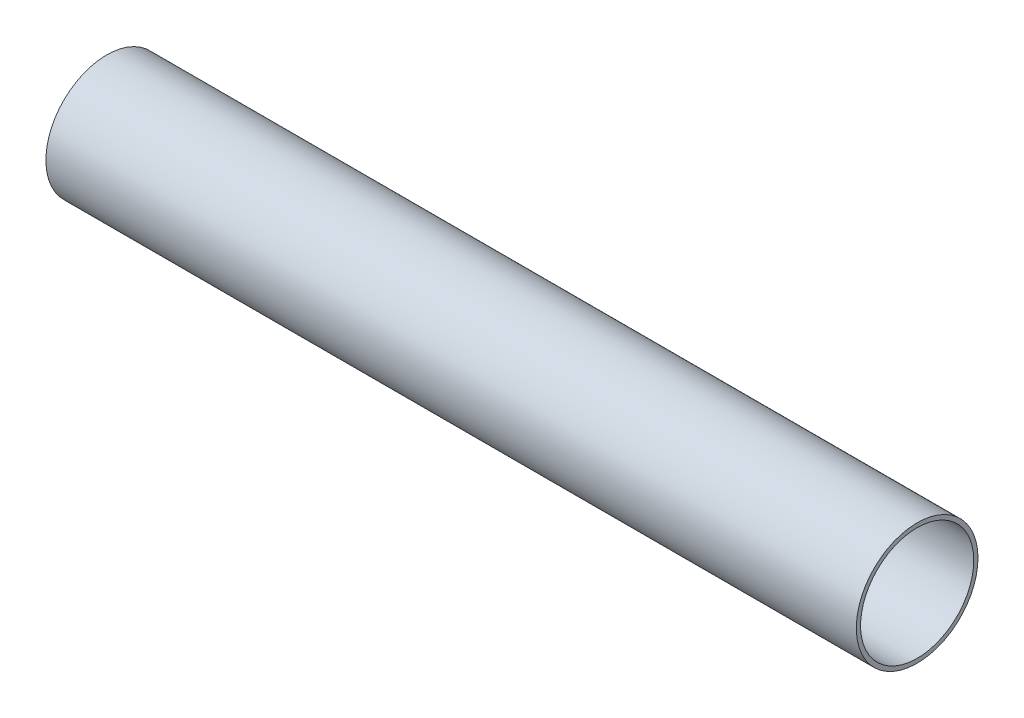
ISO-10303-21;
HEADER;
FILE_DESCRIPTION(('STEP AP214'),'2;1');
FILE_NAME('part.step','',(''),(''),'','','');
FILE_SCHEMA(('AUTOMOTIVE_DESIGN { 1 0 10303 214 1 1 1 1 }'));
ENDSEC;
DATA;
#1=APPLICATION_CONTEXT('core data for automotive mechanical design processes');
#2=APPLICATION_PROTOCOL_DEFINITION('international standard','automotive_design',2000,#1);
#3=PRODUCT_CONTEXT('',#1,'mechanical');
#4=PRODUCT('Part','Part','',(#3));
#5=PRODUCT_RELATED_PRODUCT_CATEGORY('part','',(#4));
#6=PRODUCT_DEFINITION_FORMATION('','',#4);
#7=PRODUCT_DEFINITION_CONTEXT('part definition',#1,'design');
#8=PRODUCT_DEFINITION('design','',#6,#7);
#9=PRODUCT_DEFINITION_SHAPE('','',#8);
#10=(LENGTH_UNIT() NAMED_UNIT(*) SI_UNIT(.MILLI.,.METRE.));
#11=(NAMED_UNIT(*) PLANE_ANGLE_UNIT() SI_UNIT($,.RADIAN.));
#12=(NAMED_UNIT(*) SI_UNIT($,.STERADIAN.) SOLID_ANGLE_UNIT());
#13=UNCERTAINTY_MEASURE_WITH_UNIT(LENGTH_MEASURE(1.E-05),#10,'distance_accuracy_value','');
#14=(GEOMETRIC_REPRESENTATION_CONTEXT(3) GLOBAL_UNCERTAINTY_ASSIGNED_CONTEXT((#13)) GLOBAL_UNIT_ASSIGNED_CONTEXT((#10,
#11,#12)) REPRESENTATION_CONTEXT('',''));
#15=CARTESIAN_POINT('',(0.,0.,0.));
#16=DIRECTION('',(0.,0.,1.));
#17=DIRECTION('',(1.,0.,0.));
#18=AXIS2_PLACEMENT_3D('',#15,#16,#17);
#19=CARTESIAN_POINT('',(387.35,0.,0.));
#20=DIRECTION('',(1.,0.,0.));
#21=DIRECTION('',(0.,0.,-1.));
#22=AXIS2_PLACEMENT_3D('',#19,#20,#21);
#23=PLANE('',#22);
#24=CARTESIAN_POINT('',(387.35,0.,0.));
#25=DIRECTION('',(1.,0.,0.));
#26=DIRECTION('',(0.,0.,-1.));
#27=AXIS2_PLACEMENT_3D('',#24,#25,#26);
#28=CIRCLE('',#27,29.083);
#29=CARTESIAN_POINT('',(387.35,0.,-29.083));
#30=VERTEX_POINT('',#29);
#31=EDGE_CURVE('E10',#30,#30,#28,.T.);
#32=ORIENTED_EDGE('',*,*,#31,.T.);
#33=EDGE_LOOP('',(#32));
#34=FACE_BOUND('',#33,.T.);
#35=CARTESIAN_POINT('',(387.35,0.,0.));
#36=DIRECTION('',(1.,0.,0.));
#37=DIRECTION('',(0.,0.,-1.));
#38=AXIS2_PLACEMENT_3D('',#35,#36,#37);
#39=CIRCLE('',#38,27.051);
#40=CARTESIAN_POINT('',(387.35,0.,-27.051));
#41=VERTEX_POINT('',#40);
#42=EDGE_CURVE('E40',#41,#41,#39,.T.);
#43=ORIENTED_EDGE('',*,*,#42,.F.);
#44=EDGE_LOOP('',(#43));
#45=FACE_BOUND('',#44,.T.);
#46=ADVANCED_FACE('F29',(#34,#45),#23,.T.);
#47=CARTESIAN_POINT('',(0.,0.,0.));
#48=DIRECTION('',(1.,0.,0.));
#49=DIRECTION('',(0.,0.,-1.));
#50=AXIS2_PLACEMENT_3D('',#47,#48,#49);
#51=PLANE('',#50);
#52=CARTESIAN_POINT('',(0.,0.,0.));
#53=DIRECTION('',(1.,0.,0.));
#54=DIRECTION('',(0.,0.,-1.));
#55=AXIS2_PLACEMENT_3D('',#52,#53,#54);
#56=CIRCLE('',#55,29.083);
#57=CARTESIAN_POINT('',(0.,0.,-29.083));
#58=VERTEX_POINT('',#57);
#59=EDGE_CURVE('E36',#58,#58,#56,.T.);
#60=ORIENTED_EDGE('',*,*,#59,.F.);
#61=EDGE_LOOP('',(#60));
#62=FACE_BOUND('',#61,.T.);
#63=CARTESIAN_POINT('',(0.,0.,0.));
#64=DIRECTION('',(1.,0.,0.));
#65=DIRECTION('',(0.,0.,-1.));
#66=AXIS2_PLACEMENT_3D('',#63,#64,#65);
#67=CIRCLE('',#66,27.051);
#68=CARTESIAN_POINT('',(0.,0.,-27.051));
#69=VERTEX_POINT('',#68);
#70=EDGE_CURVE('E44',#69,#69,#67,.T.);
#71=ORIENTED_EDGE('',*,*,#70,.T.);
#72=EDGE_LOOP('',(#71));
#73=FACE_BOUND('',#72,.T.);
#74=ADVANCED_FACE('F50',(#62,#73),#51,.F.);
#75=CARTESIAN_POINT('',(387.35,0.,0.));
#76=DIRECTION('',(-1.,0.,0.));
#77=DIRECTION('',(0.,0.,1.));
#78=AXIS2_PLACEMENT_3D('',#75,#76,#77);
#79=CYLINDRICAL_SURFACE('',#78,29.083);
#80=ORIENTED_EDGE('',*,*,#31,.F.);
#81=EDGE_LOOP('',(#80));
#82=FACE_BOUND('',#81,.T.);
#83=ORIENTED_EDGE('',*,*,#59,.T.);
#84=EDGE_LOOP('',(#83));
#85=FACE_BOUND('',#84,.T.);
#86=ADVANCED_FACE('F31',(#82,#85),#79,.T.);
#87=CARTESIAN_POINT('',(387.35,0.,0.));
#88=DIRECTION('',(-1.,0.,0.));
#89=DIRECTION('',(0.,0.,1.));
#90=AXIS2_PLACEMENT_3D('',#87,#88,#89);
#91=CYLINDRICAL_SURFACE('',#90,27.051);
#92=ORIENTED_EDGE('',*,*,#42,.T.);
#93=EDGE_LOOP('',(#92));
#94=FACE_BOUND('',#93,.T.);
#95=ORIENTED_EDGE('',*,*,#70,.F.);
#96=EDGE_LOOP('',(#95));
#97=FACE_BOUND('',#96,.T.);
#98=ADVANCED_FACE('F52',(#94,#97),#91,.F.);
#99=CLOSED_SHELL('',(#46,#74,#86,#98));
#100=MANIFOLD_SOLID_BREP('B2',#99);
#101=ADVANCED_BREP_SHAPE_REPRESENTATION('',(#18,#100),#14);
#102=SHAPE_DEFINITION_REPRESENTATION(#9,#101);
ENDSEC;
END-ISO-10303-21;
